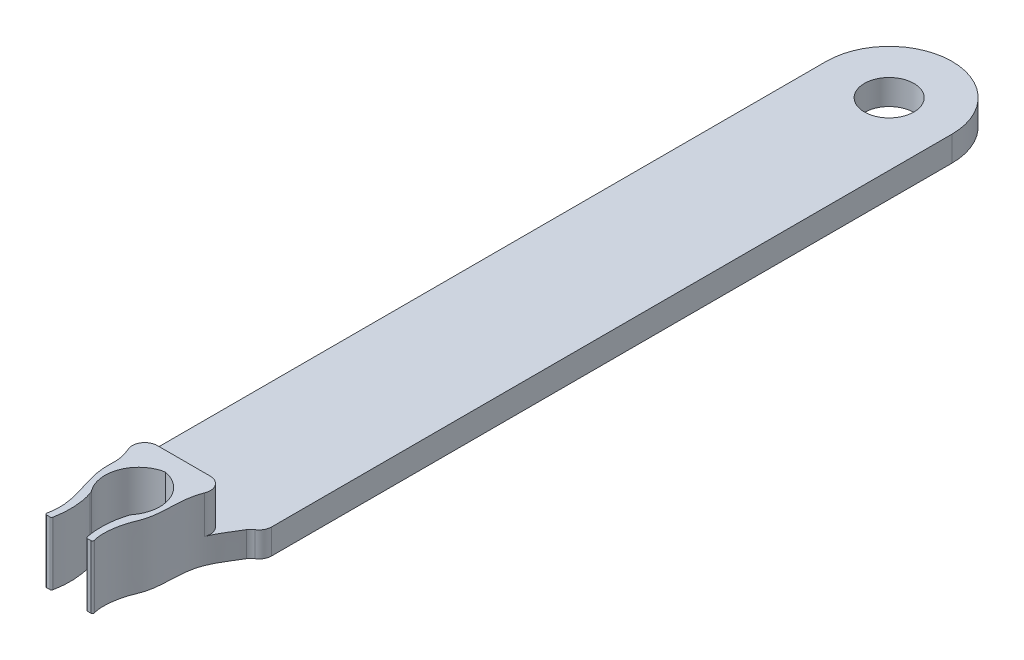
ISO-10303-21;
HEADER;
FILE_DESCRIPTION(('STEP AP214'),'2;1');
FILE_NAME('part.step','',(''),(''),'','','');
FILE_SCHEMA(('AUTOMOTIVE_DESIGN { 1 0 10303 214 1 1 1 1 }'));
ENDSEC;
DATA;
#1=APPLICATION_CONTEXT('core data for automotive mechanical design processes');
#2=APPLICATION_PROTOCOL_DEFINITION('international standard','automotive_design',2000,#1);
#3=PRODUCT_CONTEXT('',#1,'mechanical');
#4=PRODUCT('Part','Part','',(#3));
#5=PRODUCT_RELATED_PRODUCT_CATEGORY('part','',(#4));
#6=PRODUCT_DEFINITION_FORMATION('','',#4);
#7=PRODUCT_DEFINITION_CONTEXT('part definition',#1,'design');
#8=PRODUCT_DEFINITION('design','',#6,#7);
#9=PRODUCT_DEFINITION_SHAPE('','',#8);
#10=(LENGTH_UNIT() NAMED_UNIT(*) SI_UNIT(.MILLI.,.METRE.));
#11=(NAMED_UNIT(*) PLANE_ANGLE_UNIT() SI_UNIT($,.RADIAN.));
#12=(NAMED_UNIT(*) SI_UNIT($,.STERADIAN.) SOLID_ANGLE_UNIT());
#13=UNCERTAINTY_MEASURE_WITH_UNIT(LENGTH_MEASURE(1.E-05),#10,'distance_accuracy_value','');
#14=(GEOMETRIC_REPRESENTATION_CONTEXT(3) GLOBAL_UNCERTAINTY_ASSIGNED_CONTEXT((#13)) GLOBAL_UNIT_ASSIGNED_CONTEXT((#10,
#11,#12)) REPRESENTATION_CONTEXT('',''));
#15=CARTESIAN_POINT('',(0.,0.,0.));
#16=DIRECTION('',(0.,0.,1.));
#17=DIRECTION('',(1.,0.,0.));
#18=AXIS2_PLACEMENT_3D('',#15,#16,#17);
#19=CARTESIAN_POINT('',(-6.93411925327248,12.7,15.7482204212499));
#20=DIRECTION('',(0.,-1.,0.));
#21=DIRECTION('',(0.,0.,-1.));
#22=AXIS2_PLACEMENT_3D('',#19,#20,#21);
#23=PLANE('',#22);
#24=CARTESIAN_POINT('',(4.77346849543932,12.7,31.7962230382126));
#25=CARTESIAN_POINT('',(4.26261652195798,12.7,30.1479997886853));
#26=CARTESIAN_POINT('',(4.52523901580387,12.7,26.6602313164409));
#27=CARTESIAN_POINT('',(7.08560364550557,12.7,20.9954102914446));
#28=CARTESIAN_POINT('',(5.48854782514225,12.7,11.2875043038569));
#29=CARTESIAN_POINT('',(12.8342449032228,12.7,5.63803468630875));
#30=CARTESIAN_POINT('',(12.6900757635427,12.7,0.501973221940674));
#31=B_SPLINE_CURVE_WITH_KNOTS('',3,(#24,#25,#26,#27,#28,#29,#30),.UNSPECIFIED.,.F.,.F.,(4,1,1,1,
4),(0.,0.239032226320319,0.296991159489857,0.579589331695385,1.),.UNSPECIFIED.);
#32=CARTESIAN_POINT('',(4.77346849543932,12.7,31.7962230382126));
#33=VERTEX_POINT('',#32);
#34=CARTESIAN_POINT('',(7.61044065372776,12.7,12.3712513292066));
#35=VERTEX_POINT('',#34);
#36=EDGE_CURVE('E324',#33,#35,#31,.T.);
#37=ORIENTED_EDGE('',*,*,#36,.T.);
#38=CARTESIAN_POINT('',(5.25127852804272,12.7,11.43));
#39=DIRECTION('',(0.,-1.,0.));
#40=DIRECTION('',(0.,0.,-1.));
#41=AXIS2_PLACEMENT_3D('',#38,#39,#40);
#42=CIRCLE('',#41,2.54);
#43=CARTESIAN_POINT('',(5.25127852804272,12.7,8.89));
#44=VERTEX_POINT('',#43);
#45=EDGE_CURVE('E261',#35,#44,#42,.F.);
#46=ORIENTED_EDGE('',*,*,#45,.T.);
#47=DIRECTION('',(-1.,0.,0.));
#48=VECTOR('',#47,1.);
#49=CARTESIAN_POINT('',(-12.7,12.7,8.89));
#50=LINE('',#49,#48);
#51=CARTESIAN_POINT('',(-5.41802610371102,12.7,8.89));
#52=VERTEX_POINT('',#51);
#53=EDGE_CURVE('E232',#44,#52,#50,.T.);
#54=ORIENTED_EDGE('',*,*,#53,.T.);
#55=CARTESIAN_POINT('',(-5.41802610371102,12.7,11.43));
#56=DIRECTION('',(0.,-1.,0.));
#57=DIRECTION('',(0.,0.,-1.));
#58=AXIS2_PLACEMENT_3D('',#55,#56,#57);
#59=CIRCLE('',#58,2.54);
#60=CARTESIAN_POINT('',(-7.74292579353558,12.7,12.4529571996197));
#61=VERTEX_POINT('',#60);
#62=EDGE_CURVE('E259',#52,#61,#59,.F.);
#63=ORIENTED_EDGE('',*,*,#62,.T.);
#64=CARTESIAN_POINT('',(-12.6900757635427,12.7,0.50197322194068));
#65=CARTESIAN_POINT('',(-12.7085946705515,12.7,0.534595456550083));
#66=CARTESIAN_POINT('',(-12.9445111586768,12.7,3.81873144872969));
#67=CARTESIAN_POINT('',(-6.44251711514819,12.7,13.8864500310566));
#68=CARTESIAN_POINT('',(-7.36026092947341,12.7,18.4591788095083));
#69=CARTESIAN_POINT('',(-5.27387900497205,12.7,24.7590934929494));
#70=CARTESIAN_POINT('',(-4.15604476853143,12.7,29.0328933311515));
#71=CARTESIAN_POINT('',(-4.77346849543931,12.7,31.7962230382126));
#72=B_SPLINE_CURVE_WITH_KNOTS('',3,(#64,#65,#66,#67,#68,#69,#70,#71),.UNSPECIFIED.,.F.,.F.,(4,1,
1,1,1,4),(0.,0.279659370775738,0.433863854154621,0.566787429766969,0.759908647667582,
0.988953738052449),.UNSPECIFIED.);
#73=CARTESIAN_POINT('',(-4.77346849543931,12.7,31.7962230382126));
#74=VERTEX_POINT('',#73);
#75=EDGE_CURVE('E253',#61,#74,#72,.T.);
#76=ORIENTED_EDGE('',*,*,#75,.T.);
#77=CARTESIAN_POINT('',(-4.45105676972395,12.7,31.8682610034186));
#78=DIRECTION('',(0.,1.,0.));
#79=DIRECTION('',(0.,0.,1.));
#80=AXIS2_PLACEMENT_3D('',#77,#78,#79);
#81=CIRCLE('',#80,0.330361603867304);
#82=CARTESIAN_POINT('',(-4.45105676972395,12.7,32.1986226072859));
#83=VERTEX_POINT('',#82);
#84=EDGE_CURVE('E242',#74,#83,#81,.T.);
#85=ORIENTED_EDGE('',*,*,#84,.T.);
#86=DIRECTION('',(1.,0.,0.));
#87=VECTOR('',#86,1.);
#88=CARTESIAN_POINT('',(-4.45105676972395,12.7,32.1986226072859));
#89=LINE('',#88,#87);
#90=CARTESIAN_POINT('',(-3.77597646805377,12.7,32.1986226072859));
#91=VERTEX_POINT('',#90);
#92=EDGE_CURVE('E605',#83,#91,#89,.T.);
#93=ORIENTED_EDGE('',*,*,#92,.T.);
#94=CARTESIAN_POINT('',(-3.77597646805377,12.7,31.8682610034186));
#95=DIRECTION('',(0.,1.,0.));
#96=DIRECTION('',(0.,0.,-1.));
#97=AXIS2_PLACEMENT_3D('',#94,#95,#96);
#98=CIRCLE('',#97,0.330361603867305);
#99=CARTESIAN_POINT('',(-3.45189480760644,12.7,31.932369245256));
#100=VERTEX_POINT('',#99);
#101=EDGE_CURVE('E488',#91,#100,#98,.T.);
#102=ORIENTED_EDGE('',*,*,#101,.T.);
#103=CARTESIAN_POINT('',(-3.45189480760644,12.7,31.932369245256));
#104=CARTESIAN_POINT('',(-3.03837590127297,12.7,29.8419376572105));
#105=CARTESIAN_POINT('',(-3.0285914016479,12.7,27.2020407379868));
#106=CARTESIAN_POINT('',(-3.6668448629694,12.7,24.6575247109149));
#107=CARTESIAN_POINT('',(-3.83488723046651,12.7,24.1124032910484));
#108=B_SPLINE_CURVE_WITH_KNOTS('',3,(#103,#104,#105,#106,#107),.UNSPECIFIED.,.F.,.F.,(4,1,4),
(0.0550755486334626,0.772138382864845,0.969570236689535),.UNSPECIFIED.);
#109=CARTESIAN_POINT('',(-3.83488723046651,12.7,24.1124032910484));
#110=VERTEX_POINT('',#109);
#111=EDGE_CURVE('E505',#100,#110,#108,.T.);
#112=ORIENTED_EDGE('',*,*,#111,.T.);
#113=CARTESIAN_POINT('',(-6.26217420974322,12.7,24.8606531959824));
#114=DIRECTION('',(0.,1.,0.));
#115=DIRECTION('',(0.,0.,-1.));
#116=AXIS2_PLACEMENT_3D('',#113,#114,#115);
#117=CIRCLE('',#116,2.54);
#118=CARTESIAN_POINT('',(-4.21241176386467,12.7,23.3606285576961));
#119=VERTEX_POINT('',#118);
#120=EDGE_CURVE('E502',#110,#119,#117,.T.);
#121=ORIENTED_EDGE('',*,*,#120,.T.);
#122=CARTESIAN_POINT('',(1.25597785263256,12.7,19.3588384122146));
#123=DIRECTION('',(0.,-1.,0.));
#124=DIRECTION('',(0.,0.,1.));
#125=AXIS2_PLACEMENT_3D('',#122,#123,#124);
#126=CIRCLE('',#125,6.77625334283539);
#127=CARTESIAN_POINT('',(0.,12.7,12.7));
#128=VERTEX_POINT('',#127);
#129=EDGE_CURVE('E504',#119,#128,#126,.T.);
#130=ORIENTED_EDGE('',*,*,#129,.T.);
#131=CARTESIAN_POINT('',(-1.25597785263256,12.7,19.3588384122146));
#132=DIRECTION('',(0.,-1.,0.));
#133=DIRECTION('',(0.,0.,-1.));
#134=AXIS2_PLACEMENT_3D('',#131,#132,#133);
#135=CIRCLE('',#134,6.77625334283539);
#136=CARTESIAN_POINT('',(4.21241176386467,12.7,23.3606285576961));
#137=VERTEX_POINT('',#136);
#138=EDGE_CURVE('E507',#128,#137,#135,.T.);
#139=ORIENTED_EDGE('',*,*,#138,.T.);
#140=CARTESIAN_POINT('',(6.26217420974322,12.7,24.8606531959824));
#141=DIRECTION('',(0.,1.,0.));
#142=DIRECTION('',(0.,0.,1.));
#143=AXIS2_PLACEMENT_3D('',#140,#141,#142);
#144=CIRCLE('',#143,2.54);
#145=CARTESIAN_POINT('',(3.83488723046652,12.7,24.1124032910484));
#146=VERTEX_POINT('',#145);
#147=EDGE_CURVE('E374',#137,#146,#144,.T.);
#148=ORIENTED_EDGE('',*,*,#147,.T.);
#149=CARTESIAN_POINT('',(3.83488723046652,12.7,24.1124032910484));
#150=CARTESIAN_POINT('',(3.66684486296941,12.7,24.6575247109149));
#151=CARTESIAN_POINT('',(3.02859140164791,12.7,27.2020407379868));
#152=CARTESIAN_POINT('',(3.03837590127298,12.7,29.8419376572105));
#153=CARTESIAN_POINT('',(3.45189480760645,12.7,31.932369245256));
#154=B_SPLINE_CURVE_WITH_KNOTS('',3,(#149,#150,#151,#152,#153),.UNSPECIFIED.,.F.,.F.,(4,1,4),
(0.0550755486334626,0.252507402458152,0.969570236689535),.UNSPECIFIED.);
#155=CARTESIAN_POINT('',(3.45189480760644,12.7,31.932369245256));
#156=VERTEX_POINT('',#155);
#157=EDGE_CURVE('E367',#146,#156,#154,.T.);
#158=ORIENTED_EDGE('',*,*,#157,.T.);
#159=CARTESIAN_POINT('',(3.77597646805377,12.7,31.8682610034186));
#160=DIRECTION('',(0.,1.,0.));
#161=DIRECTION('',(0.,0.,1.));
#162=AXIS2_PLACEMENT_3D('',#159,#160,#161);
#163=CIRCLE('',#162,0.330361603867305);
#164=CARTESIAN_POINT('',(3.77597646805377,12.7,32.1986226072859));
#165=VERTEX_POINT('',#164);
#166=EDGE_CURVE('E373',#156,#165,#163,.T.);
#167=ORIENTED_EDGE('',*,*,#166,.T.);
#168=DIRECTION('',(1.,0.,0.));
#169=VECTOR('',#168,1.);
#170=CARTESIAN_POINT('',(4.45105676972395,12.7,32.1986226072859));
#171=LINE('',#170,#169);
#172=CARTESIAN_POINT('',(4.45105676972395,12.7,32.1986226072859));
#173=VERTEX_POINT('',#172);
#174=EDGE_CURVE('E379',#165,#173,#171,.T.);
#175=ORIENTED_EDGE('',*,*,#174,.T.);
#176=CARTESIAN_POINT('',(4.45105676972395,12.7,31.8682610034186));
#177=DIRECTION('',(0.,1.,0.));
#178=DIRECTION('',(0.,0.,-1.));
#179=AXIS2_PLACEMENT_3D('',#176,#177,#178);
#180=CIRCLE('',#179,0.330361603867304);
#181=EDGE_CURVE('E327',#173,#33,#180,.T.);
#182=ORIENTED_EDGE('',*,*,#181,.T.);
#183=EDGE_LOOP('',(#37,#46,#54,#63,#76,#85,#93,#102,#112,#121,#130,#139,#148,#158,#167,#175,#182));
#184=FACE_BOUND('',#183,.T.);
#185=ADVANCED_FACE('F32',(#184),#23,.F.);
#186=DIRECTION('',(0.,-1.,0.));
#187=VECTOR('',#186,1.);
#188=SURFACE_OF_LINEAR_EXTRUSION('',#72,#187);
#189=CARTESIAN_POINT('',(-12.6900757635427,5.08,0.50197322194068));
#190=CARTESIAN_POINT('',(-12.7085946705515,5.08,0.534595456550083));
#191=CARTESIAN_POINT('',(-12.9445111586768,5.08,3.81873144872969));
#192=CARTESIAN_POINT('',(-6.44251711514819,5.08,13.8864500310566));
#193=CARTESIAN_POINT('',(-7.36026092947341,5.08,18.4591788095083));
#194=CARTESIAN_POINT('',(-5.27387900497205,5.08,24.7590934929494));
#195=CARTESIAN_POINT('',(-4.15604476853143,5.08,29.0328933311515));
#196=CARTESIAN_POINT('',(-4.77346849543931,5.08,31.7962230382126));
#197=B_SPLINE_CURVE_WITH_KNOTS('',3,(#189,#190,#191,#192,#193,#194,#195,#196),.UNSPECIFIED.,.F.,
.F.,(4,1,1,1,1,4),(0.,0.279659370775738,0.433863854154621,0.566787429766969,0.759908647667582,
0.988953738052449),.UNSPECIFIED.);
#198=CARTESIAN_POINT('',(-10.6093893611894,5.08,7.06233555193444));
#199=VERTEX_POINT('',#198);
#200=CARTESIAN_POINT('',(-7.74292579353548,5.08,12.4529571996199));
#201=VERTEX_POINT('',#200);
#202=EDGE_CURVE('E290',#199,#201,#197,.T.);
#203=ORIENTED_EDGE('',*,*,#202,.F.);
#204=DIRECTION('',(0.,-1.,0.));
#205=VECTOR('',#204,1.);
#206=CARTESIAN_POINT('',(-10.6093893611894,5.08,7.06233555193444));
#207=LINE('',#206,#205);
#208=CARTESIAN_POINT('',(-10.6093893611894,0.,7.06233555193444));
#209=VERTEX_POINT('',#208);
#210=EDGE_CURVE('E289',#199,#209,#207,.T.);
#211=ORIENTED_EDGE('',*,*,#210,.T.);
#212=CARTESIAN_POINT('',(-12.6900757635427,0.,0.50197322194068));
#213=CARTESIAN_POINT('',(-12.7085946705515,0.,0.534595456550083));
#214=CARTESIAN_POINT('',(-12.9445111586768,0.,3.81873144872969));
#215=CARTESIAN_POINT('',(-6.44251711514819,0.,13.8864500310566));
#216=CARTESIAN_POINT('',(-7.36026092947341,0.,18.4591788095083));
#217=CARTESIAN_POINT('',(-5.27387900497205,0.,24.7590934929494));
#218=CARTESIAN_POINT('',(-4.15604476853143,0.,29.0328933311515));
#219=CARTESIAN_POINT('',(-4.77346849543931,0.,31.7962230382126));
#220=B_SPLINE_CURVE_WITH_KNOTS('',3,(#212,#213,#214,#215,#216,#217,#218,#219),.UNSPECIFIED.,.F.,
.F.,(4,1,1,1,1,4),(0.,0.279659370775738,0.433863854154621,0.566787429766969,0.759908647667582,
0.988953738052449),.UNSPECIFIED.);
#221=CARTESIAN_POINT('',(-4.77346849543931,0.,31.7962230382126));
#222=VERTEX_POINT('',#221);
#223=EDGE_CURVE('E293',#209,#222,#220,.T.);
#224=ORIENTED_EDGE('',*,*,#223,.T.);
#225=DIRECTION('',(0.,-1.,0.));
#226=VECTOR('',#225,1.);
#227=CARTESIAN_POINT('',(-4.77346849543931,12.7,31.7962230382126));
#228=LINE('',#227,#226);
#229=EDGE_CURVE('E308',#74,#222,#228,.T.);
#230=ORIENTED_EDGE('',*,*,#229,.F.);
#231=ORIENTED_EDGE('',*,*,#75,.F.);
#232=DIRECTION('',(0.,-1.,0.));
#233=VECTOR('',#232,1.);
#234=CARTESIAN_POINT('',(-7.74292579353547,12.7,12.4529571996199));
#235=LINE('',#234,#233);
#236=EDGE_CURVE('E268',#61,#201,#235,.T.);
#237=ORIENTED_EDGE('',*,*,#236,.T.);
#238=EDGE_LOOP('',(#203,#211,#224,#230,#231,#237));
#239=FACE_BOUND('',#238,.T.);
#240=ADVANCED_FACE('F249',(#239),#188,.F.);
#241=DIRECTION('',(0.,-1.,0.));
#242=VECTOR('',#241,1.);
#243=SURFACE_OF_LINEAR_EXTRUSION('',#31,#242);
#244=CARTESIAN_POINT('',(4.77346849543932,0.,31.7962230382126));
#245=CARTESIAN_POINT('',(4.26261652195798,0.,30.1479997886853));
#246=CARTESIAN_POINT('',(4.52523901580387,0.,26.6602313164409));
#247=CARTESIAN_POINT('',(7.08560364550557,0.,20.9954102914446));
#248=CARTESIAN_POINT('',(5.48854782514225,0.,11.2875043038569));
#249=CARTESIAN_POINT('',(12.8342449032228,0.,5.63803468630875));
#250=CARTESIAN_POINT('',(12.6900757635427,0.,0.501973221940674));
#251=B_SPLINE_CURVE_WITH_KNOTS('',3,(#244,#245,#246,#247,#248,#249,#250),.UNSPECIFIED.,.F.,.F.,
(4,1,1,1,4),(0.,0.239032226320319,0.296991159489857,0.579589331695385,1.),.UNSPECIFIED.);
#252=CARTESIAN_POINT('',(4.77346849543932,0.,31.7962230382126));
#253=VERTEX_POINT('',#252);
#254=CARTESIAN_POINT('',(10.6212860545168,0.,6.99353899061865));
#255=VERTEX_POINT('',#254);
#256=EDGE_CURVE('E256',#253,#255,#251,.T.);
#257=ORIENTED_EDGE('',*,*,#256,.T.);
#258=DIRECTION('',(0.,-1.,0.));
#259=VECTOR('',#258,1.);
#260=CARTESIAN_POINT('',(10.6212860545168,0.,6.99353899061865));
#261=LINE('',#260,#259);
#262=CARTESIAN_POINT('',(10.6212860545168,5.08,6.99353899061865));
#263=VERTEX_POINT('',#262);
#264=EDGE_CURVE('E395',#255,#263,#261,.F.);
#265=ORIENTED_EDGE('',*,*,#264,.T.);
#266=CARTESIAN_POINT('',(4.77346849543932,5.08,31.7962230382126));
#267=CARTESIAN_POINT('',(4.26261652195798,5.08,30.1479997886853));
#268=CARTESIAN_POINT('',(4.52523901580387,5.08,26.6602313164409));
#269=CARTESIAN_POINT('',(7.08560364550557,5.08,20.9954102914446));
#270=CARTESIAN_POINT('',(5.48854782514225,5.08,11.2875043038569));
#271=CARTESIAN_POINT('',(12.8342449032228,5.08,5.63803468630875));
#272=CARTESIAN_POINT('',(12.6900757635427,5.08,0.501973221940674));
#273=B_SPLINE_CURVE_WITH_KNOTS('',3,(#266,#267,#268,#269,#270,#271,#272),.UNSPECIFIED.,.F.,.F.,
(4,1,1,1,4),(0.,0.239032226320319,0.296991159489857,0.579589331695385,1.),.UNSPECIFIED.);
#274=CARTESIAN_POINT('',(7.61044065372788,5.08,12.3712513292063));
#275=VERTEX_POINT('',#274);
#276=EDGE_CURVE('E237',#275,#263,#273,.T.);
#277=ORIENTED_EDGE('',*,*,#276,.F.);
#278=DIRECTION('',(0.,-1.,0.));
#279=VECTOR('',#278,1.);
#280=CARTESIAN_POINT('',(7.61044065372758,5.08,12.3712513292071));
#281=LINE('',#280,#279);
#282=EDGE_CURVE('E262',#275,#35,#281,.F.);
#283=ORIENTED_EDGE('',*,*,#282,.T.);
#284=ORIENTED_EDGE('',*,*,#36,.F.);
#285=DIRECTION('',(0.,-1.,0.));
#286=VECTOR('',#285,1.);
#287=CARTESIAN_POINT('',(4.77346849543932,12.7,31.7962230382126));
#288=LINE('',#287,#286);
#289=EDGE_CURVE('E326',#33,#253,#288,.T.);
#290=ORIENTED_EDGE('',*,*,#289,.T.);
#291=EDGE_LOOP('',(#257,#265,#277,#283,#284,#290));
#292=FACE_BOUND('',#291,.T.);
#293=ADVANCED_FACE('F342',(#292),#243,.F.);
#294=CARTESIAN_POINT('',(-6.93411925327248,0.,15.7482204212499));
#295=DIRECTION('',(0.,-1.,0.));
#296=DIRECTION('',(0.,0.,-1.));
#297=AXIS2_PLACEMENT_3D('',#294,#295,#296);
#298=PLANE('',#297);
#299=CARTESIAN_POINT('',(0.,0.,-133.35));
#300=DIRECTION('',(0.,1.,0.));
#301=DIRECTION('',(0.,0.,1.));
#302=AXIS2_PLACEMENT_3D('',#299,#300,#301);
#303=CIRCLE('',#302,4.99999);
#304=CARTESIAN_POINT('',(0.,0.,-128.35001));
#305=VERTEX_POINT('',#304);
#306=EDGE_CURVE('E229',#305,#305,#303,.T.);
#307=ORIENTED_EDGE('',*,*,#306,.T.);
#308=EDGE_LOOP('',(#307));
#309=FACE_BOUND('',#308,.T.);
#310=DIRECTION('',(0.,0.,-1.));
#311=VECTOR('',#310,1.);
#312=CARTESIAN_POINT('',(12.7,0.,6.35));
#313=LINE('',#312,#311);
#314=CARTESIAN_POINT('',(12.7,0.,3.94992772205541));
#315=VERTEX_POINT('',#314);
#316=CARTESIAN_POINT('',(12.7,0.,-133.35));
#317=VERTEX_POINT('',#316);
#318=EDGE_CURVE('E198',#315,#317,#313,.T.);
#319=ORIENTED_EDGE('',*,*,#318,.F.);
#320=CARTESIAN_POINT('',(10.16,0.,3.94992772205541));
#321=DIRECTION('',(0.,-1.,0.));
#322=DIRECTION('',(0.,0.,-1.));
#323=AXIS2_PLACEMENT_3D('',#320,#321,#322);
#324=CIRCLE('',#323,2.54);
#325=CARTESIAN_POINT('',(11.4842719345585,0.,6.11739256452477));
#326=VERTEX_POINT('',#325);
#327=EDGE_CURVE('E284',#315,#326,#324,.T.);
#328=ORIENTED_EDGE('',*,*,#327,.T.);
#329=CARTESIAN_POINT('',(12.8085438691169,0.,8.28485740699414));
#330=DIRECTION('',(0.,-1.,0.));
#331=DIRECTION('',(0.,0.,-1.));
#332=AXIS2_PLACEMENT_3D('',#329,#330,#331);
#333=CIRCLE('',#332,2.54);
#334=EDGE_CURVE('E11',#326,#255,#333,.F.);
#335=ORIENTED_EDGE('',*,*,#334,.T.);
#336=ORIENTED_EDGE('',*,*,#256,.F.);
#337=CARTESIAN_POINT('',(4.45105676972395,0.,31.8682610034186));
#338=DIRECTION('',(0.,1.,0.));
#339=DIRECTION('',(0.,0.,-1.));
#340=AXIS2_PLACEMENT_3D('',#337,#338,#339);
#341=CIRCLE('',#340,0.330361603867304);
#342=CARTESIAN_POINT('',(4.45105676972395,0.,32.1986226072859));
#343=VERTEX_POINT('',#342);
#344=EDGE_CURVE('E388',#343,#253,#341,.T.);
#345=ORIENTED_EDGE('',*,*,#344,.F.);
#346=DIRECTION('',(1.,0.,0.));
#347=VECTOR('',#346,1.);
#348=CARTESIAN_POINT('',(4.45105676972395,0.,32.1986226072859));
#349=LINE('',#348,#347);
#350=CARTESIAN_POINT('',(3.77597646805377,0.,32.1986226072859));
#351=VERTEX_POINT('',#350);
#352=EDGE_CURVE('E449',#351,#343,#349,.T.);
#353=ORIENTED_EDGE('',*,*,#352,.F.);
#354=CARTESIAN_POINT('',(3.77597646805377,0.,31.8682610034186));
#355=DIRECTION('',(0.,1.,0.));
#356=DIRECTION('',(0.,0.,1.));
#357=AXIS2_PLACEMENT_3D('',#354,#355,#356);
#358=CIRCLE('',#357,0.330361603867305);
#359=CARTESIAN_POINT('',(3.45189480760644,0.,31.932369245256));
#360=VERTEX_POINT('',#359);
#361=EDGE_CURVE('E444',#360,#351,#358,.T.);
#362=ORIENTED_EDGE('',*,*,#361,.F.);
#363=CARTESIAN_POINT('',(3.83488723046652,0.,24.1124032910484));
#364=CARTESIAN_POINT('',(3.66684486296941,0.,24.6575247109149));
#365=CARTESIAN_POINT('',(3.02859140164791,0.,27.2020407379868));
#366=CARTESIAN_POINT('',(3.03837590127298,0.,29.8419376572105));
#367=CARTESIAN_POINT('',(3.45189480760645,0.,31.932369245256));
#368=B_SPLINE_CURVE_WITH_KNOTS('',3,(#363,#364,#365,#366,#367),.UNSPECIFIED.,.F.,.F.,(4,1,4),
(0.0550755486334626,0.252507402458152,0.969570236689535),.UNSPECIFIED.);
#369=CARTESIAN_POINT('',(3.83488723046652,0.,24.1124032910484));
#370=VERTEX_POINT('',#369);
#371=EDGE_CURVE('E440',#370,#360,#368,.T.);
#372=ORIENTED_EDGE('',*,*,#371,.F.);
#373=CARTESIAN_POINT('',(6.26217420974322,0.,24.8606531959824));
#374=DIRECTION('',(0.,1.,0.));
#375=DIRECTION('',(0.,0.,1.));
#376=AXIS2_PLACEMENT_3D('',#373,#374,#375);
#377=CIRCLE('',#376,2.54);
#378=CARTESIAN_POINT('',(4.21241176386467,0.,23.3606285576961));
#379=VERTEX_POINT('',#378);
#380=EDGE_CURVE('E438',#379,#370,#377,.T.);
#381=ORIENTED_EDGE('',*,*,#380,.F.);
#382=CARTESIAN_POINT('',(-1.25597785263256,0.,19.3588384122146));
#383=DIRECTION('',(0.,-1.,0.));
#384=DIRECTION('',(0.,0.,-1.));
#385=AXIS2_PLACEMENT_3D('',#382,#383,#384);
#386=CIRCLE('',#385,6.77625334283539);
#387=CARTESIAN_POINT('',(0.,0.,12.7));
#388=VERTEX_POINT('',#387);
#389=EDGE_CURVE('E436',#388,#379,#386,.T.);
#390=ORIENTED_EDGE('',*,*,#389,.F.);
#391=CARTESIAN_POINT('',(1.25597785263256,0.,19.3588384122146));
#392=DIRECTION('',(0.,-1.,0.));
#393=DIRECTION('',(0.,0.,1.));
#394=AXIS2_PLACEMENT_3D('',#391,#392,#393);
#395=CIRCLE('',#394,6.77625334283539);
#396=CARTESIAN_POINT('',(-4.21241176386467,0.,23.3606285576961));
#397=VERTEX_POINT('',#396);
#398=EDGE_CURVE('E434',#397,#388,#395,.T.);
#399=ORIENTED_EDGE('',*,*,#398,.F.);
#400=CARTESIAN_POINT('',(-6.26217420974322,0.,24.8606531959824));
#401=DIRECTION('',(0.,1.,0.));
#402=DIRECTION('',(0.,0.,-1.));
#403=AXIS2_PLACEMENT_3D('',#400,#401,#402);
#404=CIRCLE('',#403,2.54);
#405=CARTESIAN_POINT('',(-3.83488723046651,0.,24.1124032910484));
#406=VERTEX_POINT('',#405);
#407=EDGE_CURVE('E429',#406,#397,#404,.T.);
#408=ORIENTED_EDGE('',*,*,#407,.F.);
#409=CARTESIAN_POINT('',(-3.45189480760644,0.,31.932369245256));
#410=CARTESIAN_POINT('',(-3.03837590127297,0.,29.8419376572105));
#411=CARTESIAN_POINT('',(-3.0285914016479,0.,27.2020407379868));
#412=CARTESIAN_POINT('',(-3.6668448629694,0.,24.6575247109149));
#413=CARTESIAN_POINT('',(-3.83488723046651,0.,24.1124032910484));
#414=B_SPLINE_CURVE_WITH_KNOTS('',3,(#409,#410,#411,#412,#413),.UNSPECIFIED.,.F.,.F.,(4,1,4),
(0.0550755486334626,0.772138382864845,0.969570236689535),.UNSPECIFIED.);
#415=CARTESIAN_POINT('',(-3.45189480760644,0.,31.932369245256));
#416=VERTEX_POINT('',#415);
#417=EDGE_CURVE('E425',#416,#406,#414,.T.);
#418=ORIENTED_EDGE('',*,*,#417,.F.);
#419=CARTESIAN_POINT('',(-3.77597646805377,0.,31.8682610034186));
#420=DIRECTION('',(0.,1.,0.));
#421=DIRECTION('',(0.,0.,-1.));
#422=AXIS2_PLACEMENT_3D('',#419,#420,#421);
#423=CIRCLE('',#422,0.330361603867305);
#424=CARTESIAN_POINT('',(-3.77597646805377,0.,32.1986226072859));
#425=VERTEX_POINT('',#424);
#426=EDGE_CURVE('E421',#425,#416,#423,.T.);
#427=ORIENTED_EDGE('',*,*,#426,.F.);
#428=DIRECTION('',(1.,0.,0.));
#429=VECTOR('',#428,1.);
#430=CARTESIAN_POINT('',(-4.45105676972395,0.,32.1986226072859));
#431=LINE('',#430,#429);
#432=CARTESIAN_POINT('',(-4.45105676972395,0.,32.1986226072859));
#433=VERTEX_POINT('',#432);
#434=EDGE_CURVE('E419',#433,#425,#431,.T.);
#435=ORIENTED_EDGE('',*,*,#434,.F.);
#436=CARTESIAN_POINT('',(-4.45105676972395,0.,31.8682610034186));
#437=DIRECTION('',(0.,1.,0.));
#438=DIRECTION('',(0.,0.,1.));
#439=AXIS2_PLACEMENT_3D('',#436,#437,#438);
#440=CIRCLE('',#439,0.330361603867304);
#441=EDGE_CURVE('E418',#222,#433,#440,.T.);
#442=ORIENTED_EDGE('',*,*,#441,.F.);
#443=ORIENTED_EDGE('',*,*,#223,.F.);
#444=CARTESIAN_POINT('',(-12.8539327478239,0.,8.25129517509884));
#445=DIRECTION('',(0.,-1.,0.));
#446=DIRECTION('',(0.,0.,-1.));
#447=AXIS2_PLACEMENT_3D('',#444,#445,#446);
#448=CIRCLE('',#447,2.54);
#449=CARTESIAN_POINT('',(-11.5069663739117,0.,6.09786034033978));
#450=VERTEX_POINT('',#449);
#451=EDGE_CURVE('E402',#209,#450,#448,.F.);
#452=ORIENTED_EDGE('',*,*,#451,.T.);
#453=CARTESIAN_POINT('',(-10.16,0.,3.94442550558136));
#454=DIRECTION('',(0.,-1.,0.));
#455=DIRECTION('',(0.,0.,-1.));
#456=AXIS2_PLACEMENT_3D('',#453,#454,#455);
#457=CIRCLE('',#456,2.54);
#458=CARTESIAN_POINT('',(-12.7,0.,3.94442550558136));
#459=VERTEX_POINT('',#458);
#460=EDGE_CURVE('E282',#450,#459,#457,.T.);
#461=ORIENTED_EDGE('',*,*,#460,.T.);
#462=DIRECTION('',(0.,0.,1.));
#463=VECTOR('',#462,1.);
#464=CARTESIAN_POINT('',(-12.7,0.,6.35));
#465=LINE('',#464,#463);
#466=CARTESIAN_POINT('',(-12.7,0.,-133.35));
#467=VERTEX_POINT('',#466);
#468=EDGE_CURVE('E209',#467,#459,#465,.T.);
#469=ORIENTED_EDGE('',*,*,#468,.F.);
#470=CARTESIAN_POINT('',(0.,0.,-133.35));
#471=DIRECTION('',(0.,1.,0.));
#472=DIRECTION('',(0.,0.,-1.));
#473=AXIS2_PLACEMENT_3D('',#470,#471,#472);
#474=CIRCLE('',#473,12.7);
#475=EDGE_CURVE('E208',#317,#467,#474,.T.);
#476=ORIENTED_EDGE('',*,*,#475,.F.);
#477=EDGE_LOOP('',(#319,#328,#335,#336,#345,#353,#362,#372,#381,#390,#399,#408,#418,#427,#435,
#442,#443,#452,#461,#469,#476));
#478=FACE_BOUND('',#477,.T.);
#479=ADVANCED_FACE('F220',(#309,#478),#298,.T.);
#480=CARTESIAN_POINT('',(-4.45105676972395,12.7,31.8682610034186));
#481=DIRECTION('',(0.,-1.,0.));
#482=DIRECTION('',(0.,0.,-1.));
#483=AXIS2_PLACEMENT_3D('',#480,#481,#482);
#484=CYLINDRICAL_SURFACE('',#483,0.330361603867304);
#485=ORIENTED_EDGE('',*,*,#441,.T.);
#486=DIRECTION('',(0.,-1.,0.));
#487=VECTOR('',#486,1.);
#488=CARTESIAN_POINT('',(-4.45105676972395,12.7,32.1986226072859));
#489=LINE('',#488,#487);
#490=EDGE_CURVE('E314',#83,#433,#489,.T.);
#491=ORIENTED_EDGE('',*,*,#490,.F.);
#492=ORIENTED_EDGE('',*,*,#84,.F.);
#493=ORIENTED_EDGE('',*,*,#229,.T.);
#494=EDGE_LOOP('',(#485,#491,#492,#493));
#495=FACE_BOUND('',#494,.T.);
#496=ADVANCED_FACE('F604',(#495),#484,.T.);
#497=CARTESIAN_POINT('',(-4.45105676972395,12.7,32.1986226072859));
#498=DIRECTION('',(0.,0.,-1.));
#499=DIRECTION('',(-1.,0.,0.));
#500=AXIS2_PLACEMENT_3D('',#497,#498,#499);
#501=PLANE('',#500);
#502=ORIENTED_EDGE('',*,*,#434,.T.);
#503=DIRECTION('',(0.,-1.,0.));
#504=VECTOR('',#503,1.);
#505=CARTESIAN_POINT('',(-3.77597646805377,12.7,32.1986226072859));
#506=LINE('',#505,#504);
#507=EDGE_CURVE('E320',#91,#425,#506,.T.);
#508=ORIENTED_EDGE('',*,*,#507,.F.);
#509=ORIENTED_EDGE('',*,*,#92,.F.);
#510=ORIENTED_EDGE('',*,*,#490,.T.);
#511=EDGE_LOOP('',(#502,#508,#509,#510));
#512=FACE_BOUND('',#511,.T.);
#513=ADVANCED_FACE('F606',(#512),#501,.F.);
#514=CARTESIAN_POINT('',(-3.77597646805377,12.7,31.8682610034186));
#515=DIRECTION('',(0.,-1.,0.));
#516=DIRECTION('',(0.,0.,-1.));
#517=AXIS2_PLACEMENT_3D('',#514,#515,#516);
#518=CYLINDRICAL_SURFACE('',#517,0.330361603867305);
#519=ORIENTED_EDGE('',*,*,#426,.T.);
#520=DIRECTION('',(0.,-1.,0.));
#521=VECTOR('',#520,1.);
#522=CARTESIAN_POINT('',(-3.45189480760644,12.7,31.932369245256));
#523=LINE('',#522,#521);
#524=EDGE_CURVE('E479',#100,#416,#523,.T.);
#525=ORIENTED_EDGE('',*,*,#524,.F.);
#526=ORIENTED_EDGE('',*,*,#101,.F.);
#527=ORIENTED_EDGE('',*,*,#507,.T.);
#528=EDGE_LOOP('',(#519,#525,#526,#527));
#529=FACE_BOUND('',#528,.T.);
#530=ADVANCED_FACE('F486',(#529),#518,.T.);
#531=DIRECTION('',(0.,-1.,0.));
#532=VECTOR('',#531,1.);
#533=SURFACE_OF_LINEAR_EXTRUSION('',#108,#532);
#534=ORIENTED_EDGE('',*,*,#417,.T.);
#535=DIRECTION('',(0.,-1.,0.));
#536=VECTOR('',#535,1.);
#537=CARTESIAN_POINT('',(-3.83488723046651,12.7,24.1124032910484));
#538=LINE('',#537,#536);
#539=EDGE_CURVE('E476',#110,#406,#538,.T.);
#540=ORIENTED_EDGE('',*,*,#539,.F.);
#541=ORIENTED_EDGE('',*,*,#111,.F.);
#542=ORIENTED_EDGE('',*,*,#524,.T.);
#543=EDGE_LOOP('',(#534,#540,#541,#542));
#544=FACE_BOUND('',#543,.T.);
#545=ADVANCED_FACE('F496',(#544),#533,.F.);
#546=CARTESIAN_POINT('',(-6.26217420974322,12.7,24.8606531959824));
#547=DIRECTION('',(0.,-1.,0.));
#548=DIRECTION('',(0.,0.,-1.));
#549=AXIS2_PLACEMENT_3D('',#546,#547,#548);
#550=CYLINDRICAL_SURFACE('',#549,2.54);
#551=ORIENTED_EDGE('',*,*,#407,.T.);
#552=DIRECTION('',(0.,-1.,0.));
#553=VECTOR('',#552,1.);
#554=CARTESIAN_POINT('',(-4.21241176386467,12.7,23.3606285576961));
#555=LINE('',#554,#553);
#556=EDGE_CURVE('E473',#119,#397,#555,.T.);
#557=ORIENTED_EDGE('',*,*,#556,.F.);
#558=ORIENTED_EDGE('',*,*,#120,.F.);
#559=ORIENTED_EDGE('',*,*,#539,.T.);
#560=EDGE_LOOP('',(#551,#557,#558,#559));
#561=FACE_BOUND('',#560,.T.);
#562=ADVANCED_FACE('F500',(#561),#550,.T.);
#563=CARTESIAN_POINT('',(1.25597785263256,12.7,19.3588384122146));
#564=DIRECTION('',(0.,-1.,0.));
#565=DIRECTION('',(0.,0.,-1.));
#566=AXIS2_PLACEMENT_3D('',#563,#564,#565);
#567=CYLINDRICAL_SURFACE('',#566,6.77625334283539);
#568=ORIENTED_EDGE('',*,*,#398,.T.);
#569=DIRECTION('',(0.,-1.,0.));
#570=VECTOR('',#569,1.);
#571=CARTESIAN_POINT('',(0.,12.7,12.7));
#572=LINE('',#571,#570);
#573=EDGE_CURVE('E470',#128,#388,#572,.T.);
#574=ORIENTED_EDGE('',*,*,#573,.F.);
#575=ORIENTED_EDGE('',*,*,#129,.F.);
#576=ORIENTED_EDGE('',*,*,#556,.T.);
#577=EDGE_LOOP('',(#568,#574,#575,#576));
#578=FACE_BOUND('',#577,.T.);
#579=ADVANCED_FACE('F532',(#578),#567,.F.);
#580=CARTESIAN_POINT('',(-1.25597785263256,12.7,19.3588384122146));
#581=DIRECTION('',(0.,-1.,0.));
#582=DIRECTION('',(0.,0.,-1.));
#583=AXIS2_PLACEMENT_3D('',#580,#581,#582);
#584=CYLINDRICAL_SURFACE('',#583,6.77625334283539);
#585=ORIENTED_EDGE('',*,*,#389,.T.);
#586=DIRECTION('',(0.,-1.,0.));
#587=VECTOR('',#586,1.);
#588=CARTESIAN_POINT('',(4.21241176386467,12.7,23.3606285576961));
#589=LINE('',#588,#587);
#590=EDGE_CURVE('E467',#137,#379,#589,.T.);
#591=ORIENTED_EDGE('',*,*,#590,.F.);
#592=ORIENTED_EDGE('',*,*,#138,.F.);
#593=ORIENTED_EDGE('',*,*,#573,.T.);
#594=EDGE_LOOP('',(#585,#591,#592,#593));
#595=FACE_BOUND('',#594,.T.);
#596=ADVANCED_FACE('F529',(#595),#584,.F.);
#597=CARTESIAN_POINT('',(6.26217420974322,12.7,24.8606531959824));
#598=DIRECTION('',(0.,-1.,0.));
#599=DIRECTION('',(0.,0.,-1.));
#600=AXIS2_PLACEMENT_3D('',#597,#598,#599);
#601=CYLINDRICAL_SURFACE('',#600,2.54);
#602=ORIENTED_EDGE('',*,*,#380,.T.);
#603=DIRECTION('',(0.,-1.,0.));
#604=VECTOR('',#603,1.);
#605=CARTESIAN_POINT('',(3.83488723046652,12.7,24.1124032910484));
#606=LINE('',#605,#604);
#607=EDGE_CURVE('E464',#146,#370,#606,.T.);
#608=ORIENTED_EDGE('',*,*,#607,.F.);
#609=ORIENTED_EDGE('',*,*,#147,.F.);
#610=ORIENTED_EDGE('',*,*,#590,.T.);
#611=EDGE_LOOP('',(#602,#608,#609,#610));
#612=FACE_BOUND('',#611,.T.);
#613=ADVANCED_FACE('F364',(#612),#601,.T.);
#614=DIRECTION('',(0.,-1.,0.));
#615=VECTOR('',#614,1.);
#616=SURFACE_OF_LINEAR_EXTRUSION('',#154,#615);
#617=ORIENTED_EDGE('',*,*,#371,.T.);
#618=DIRECTION('',(0.,-1.,0.));
#619=VECTOR('',#618,1.);
#620=CARTESIAN_POINT('',(3.45189480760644,12.7,31.932369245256));
#621=LINE('',#620,#619);
#622=EDGE_CURVE('E461',#156,#360,#621,.T.);
#623=ORIENTED_EDGE('',*,*,#622,.F.);
#624=ORIENTED_EDGE('',*,*,#157,.F.);
#625=ORIENTED_EDGE('',*,*,#607,.T.);
#626=EDGE_LOOP('',(#617,#623,#624,#625));
#627=FACE_BOUND('',#626,.T.);
#628=ADVANCED_FACE('F359',(#627),#616,.F.);
#629=CARTESIAN_POINT('',(3.77597646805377,12.7,31.8682610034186));
#630=DIRECTION('',(0.,-1.,0.));
#631=DIRECTION('',(0.,0.,-1.));
#632=AXIS2_PLACEMENT_3D('',#629,#630,#631);
#633=CYLINDRICAL_SURFACE('',#632,0.330361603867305);
#634=ORIENTED_EDGE('',*,*,#361,.T.);
#635=DIRECTION('',(0.,-1.,0.));
#636=VECTOR('',#635,1.);
#637=CARTESIAN_POINT('',(3.77597646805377,12.7,32.1986226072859));
#638=LINE('',#637,#636);
#639=EDGE_CURVE('E458',#165,#351,#638,.T.);
#640=ORIENTED_EDGE('',*,*,#639,.F.);
#641=ORIENTED_EDGE('',*,*,#166,.F.);
#642=ORIENTED_EDGE('',*,*,#622,.T.);
#643=EDGE_LOOP('',(#634,#640,#641,#642));
#644=FACE_BOUND('',#643,.T.);
#645=ADVANCED_FACE('F355',(#644),#633,.T.);
#646=CARTESIAN_POINT('',(4.45105676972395,12.7,32.1986226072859));
#647=DIRECTION('',(0.,0.,-1.));
#648=DIRECTION('',(-1.,0.,0.));
#649=AXIS2_PLACEMENT_3D('',#646,#647,#648);
#650=PLANE('',#649);
#651=ORIENTED_EDGE('',*,*,#352,.T.);
#652=DIRECTION('',(0.,-1.,0.));
#653=VECTOR('',#652,1.);
#654=CARTESIAN_POINT('',(4.45105676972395,12.7,32.1986226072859));
#655=LINE('',#654,#653);
#656=EDGE_CURVE('E391',#173,#343,#655,.T.);
#657=ORIENTED_EDGE('',*,*,#656,.F.);
#658=ORIENTED_EDGE('',*,*,#174,.F.);
#659=ORIENTED_EDGE('',*,*,#639,.T.);
#660=EDGE_LOOP('',(#651,#657,#658,#659));
#661=FACE_BOUND('',#660,.T.);
#662=ADVANCED_FACE('F351',(#661),#650,.F.);
#663=CARTESIAN_POINT('',(4.45105676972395,12.7,31.8682610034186));
#664=DIRECTION('',(0.,-1.,0.));
#665=DIRECTION('',(0.,0.,-1.));
#666=AXIS2_PLACEMENT_3D('',#663,#664,#665);
#667=CYLINDRICAL_SURFACE('',#666,0.330361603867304);
#668=ORIENTED_EDGE('',*,*,#344,.T.);
#669=ORIENTED_EDGE('',*,*,#289,.F.);
#670=ORIENTED_EDGE('',*,*,#181,.F.);
#671=ORIENTED_EDGE('',*,*,#656,.T.);
#672=EDGE_LOOP('',(#668,#669,#670,#671));
#673=FACE_BOUND('',#672,.T.);
#674=ADVANCED_FACE('F347',(#673),#667,.T.);
#675=CARTESIAN_POINT('',(-12.7,12.701,8.89));
#676=DIRECTION('',(0.,0.,-1.));
#677=DIRECTION('',(-1.,0.,0.));
#678=AXIS2_PLACEMENT_3D('',#675,#676,#677);
#679=PLANE('',#678);
#680=ORIENTED_EDGE('',*,*,#53,.F.);
#681=DIRECTION('',(0.,1.,0.));
#682=VECTOR('',#681,1.);
#683=CARTESIAN_POINT('',(5.25127852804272,5.08,8.89));
#684=LINE('',#683,#682);
#685=CARTESIAN_POINT('',(5.25127852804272,5.08,8.89));
#686=VERTEX_POINT('',#685);
#687=EDGE_CURVE('E266',#44,#686,#684,.F.);
#688=ORIENTED_EDGE('',*,*,#687,.T.);
#689=DIRECTION('',(1.,0.,0.));
#690=VECTOR('',#689,1.);
#691=CARTESIAN_POINT('',(-12.7,5.08,8.89));
#692=LINE('',#691,#690);
#693=CARTESIAN_POINT('',(-5.41802610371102,5.08,8.89));
#694=VERTEX_POINT('',#693);
#695=EDGE_CURVE('E234',#694,#686,#692,.T.);
#696=ORIENTED_EDGE('',*,*,#695,.F.);
#697=DIRECTION('',(0.,1.,0.));
#698=VECTOR('',#697,1.);
#699=CARTESIAN_POINT('',(-5.41802610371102,12.7,8.89));
#700=LINE('',#699,#698);
#701=EDGE_CURVE('E264',#694,#52,#700,.T.);
#702=ORIENTED_EDGE('',*,*,#701,.T.);
#703=EDGE_LOOP('',(#680,#688,#696,#702));
#704=FACE_BOUND('',#703,.T.);
#705=ADVANCED_FACE('F350',(#704),#679,.T.);
#706=CARTESIAN_POINT('',(0.,5.08,0.));
#707=DIRECTION('',(0.,-1.,0.));
#708=DIRECTION('',(0.,0.,-1.));
#709=AXIS2_PLACEMENT_3D('',#706,#707,#708);
#710=PLANE('',#709);
#711=CARTESIAN_POINT('',(0.,5.08,-133.35));
#712=DIRECTION('',(0.,1.,0.));
#713=DIRECTION('',(0.,0.,1.));
#714=AXIS2_PLACEMENT_3D('',#711,#712,#713);
#715=CIRCLE('',#714,4.99999);
#716=CARTESIAN_POINT('',(0.,5.08,-128.35001));
#717=VERTEX_POINT('',#716);
#718=EDGE_CURVE('E575',#717,#717,#715,.T.);
#719=ORIENTED_EDGE('',*,*,#718,.F.);
#720=EDGE_LOOP('',(#719));
#721=FACE_BOUND('',#720,.T.);
#722=ORIENTED_EDGE('',*,*,#276,.T.);
#723=CARTESIAN_POINT('',(12.8085438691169,5.08,8.28485740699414));
#724=DIRECTION('',(0.,-1.,0.));
#725=DIRECTION('',(0.,0.,-1.));
#726=AXIS2_PLACEMENT_3D('',#723,#724,#725);
#727=CIRCLE('',#726,2.54);
#728=CARTESIAN_POINT('',(11.4842719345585,5.08,6.11739256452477));
#729=VERTEX_POINT('',#728);
#730=EDGE_CURVE('E40',#263,#729,#727,.T.);
#731=ORIENTED_EDGE('',*,*,#730,.T.);
#732=CARTESIAN_POINT('',(10.16,5.08,3.94992772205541));
#733=DIRECTION('',(0.,-1.,0.));
#734=DIRECTION('',(0.,0.,-1.));
#735=AXIS2_PLACEMENT_3D('',#732,#733,#734);
#736=CIRCLE('',#735,2.54);
#737=CARTESIAN_POINT('',(12.7,5.08,3.94992772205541));
#738=VERTEX_POINT('',#737);
#739=EDGE_CURVE('E279',#729,#738,#736,.F.);
#740=ORIENTED_EDGE('',*,*,#739,.T.);
#741=DIRECTION('',(0.,0.,-1.));
#742=VECTOR('',#741,1.);
#743=CARTESIAN_POINT('',(12.7,5.08,6.35));
#744=LINE('',#743,#742);
#745=CARTESIAN_POINT('',(12.7,5.08,-133.35));
#746=VERTEX_POINT('',#745);
#747=EDGE_CURVE('E228',#738,#746,#744,.T.);
#748=ORIENTED_EDGE('',*,*,#747,.T.);
#749=CARTESIAN_POINT('',(0.,5.08,-133.35));
#750=DIRECTION('',(0.,1.,0.));
#751=DIRECTION('',(0.,0.,-1.));
#752=AXIS2_PLACEMENT_3D('',#749,#750,#751);
#753=CIRCLE('',#752,12.7);
#754=CARTESIAN_POINT('',(-12.7,5.08,-133.35));
#755=VERTEX_POINT('',#754);
#756=EDGE_CURVE('E216',#746,#755,#753,.T.);
#757=ORIENTED_EDGE('',*,*,#756,.T.);
#758=DIRECTION('',(0.,0.,1.));
#759=VECTOR('',#758,1.);
#760=CARTESIAN_POINT('',(-12.7,5.08,6.35));
#761=LINE('',#760,#759);
#762=CARTESIAN_POINT('',(-12.7,5.08,3.94442550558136));
#763=VERTEX_POINT('',#762);
#764=EDGE_CURVE('E225',#755,#763,#761,.T.);
#765=ORIENTED_EDGE('',*,*,#764,.T.);
#766=CARTESIAN_POINT('',(-10.16,5.08,3.94442550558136));
#767=DIRECTION('',(0.,-1.,0.));
#768=DIRECTION('',(0.,0.,-1.));
#769=AXIS2_PLACEMENT_3D('',#766,#767,#768);
#770=CIRCLE('',#769,2.54);
#771=CARTESIAN_POINT('',(-11.5069663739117,5.08,6.09786034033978));
#772=VERTEX_POINT('',#771);
#773=EDGE_CURVE('E276',#763,#772,#770,.F.);
#774=ORIENTED_EDGE('',*,*,#773,.T.);
#775=CARTESIAN_POINT('',(-12.8539327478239,5.08,8.25129517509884));
#776=DIRECTION('',(0.,-1.,0.));
#777=DIRECTION('',(0.,0.,-1.));
#778=AXIS2_PLACEMENT_3D('',#775,#776,#777);
#779=CIRCLE('',#778,2.54);
#780=EDGE_CURVE('E399',#772,#199,#779,.T.);
#781=ORIENTED_EDGE('',*,*,#780,.T.);
#782=ORIENTED_EDGE('',*,*,#202,.T.);
#783=CARTESIAN_POINT('',(-5.41802610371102,5.08,11.43));
#784=DIRECTION('',(0.,-1.,0.));
#785=DIRECTION('',(0.,0.,-1.));
#786=AXIS2_PLACEMENT_3D('',#783,#784,#785);
#787=CIRCLE('',#786,2.54);
#788=EDGE_CURVE('E274',#201,#694,#787,.T.);
#789=ORIENTED_EDGE('',*,*,#788,.T.);
#790=ORIENTED_EDGE('',*,*,#695,.T.);
#791=CARTESIAN_POINT('',(5.25127852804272,5.08,11.43));
#792=DIRECTION('',(0.,-1.,0.));
#793=DIRECTION('',(0.,0.,-1.));
#794=AXIS2_PLACEMENT_3D('',#791,#792,#793);
#795=CIRCLE('',#794,2.54);
#796=EDGE_CURVE('E271',#686,#275,#795,.T.);
#797=ORIENTED_EDGE('',*,*,#796,.T.);
#798=EDGE_LOOP('',(#722,#731,#740,#748,#757,#765,#774,#781,#782,#789,#790,#797));
#799=FACE_BOUND('',#798,.T.);
#800=ADVANCED_FACE('F547',(#721,#799),#710,.F.);
#801=CARTESIAN_POINT('',(5.25127852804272,8.89,11.43));
#802=DIRECTION('',(0.,-1.,0.));
#803=DIRECTION('',(0.,0.,-1.));
#804=AXIS2_PLACEMENT_3D('',#801,#802,#803);
#805=CYLINDRICAL_SURFACE('',#804,2.54);
#806=ORIENTED_EDGE('',*,*,#796,.F.);
#807=ORIENTED_EDGE('',*,*,#687,.F.);
#808=ORIENTED_EDGE('',*,*,#45,.F.);
#809=ORIENTED_EDGE('',*,*,#282,.F.);
#810=EDGE_LOOP('',(#806,#807,#808,#809));
#811=FACE_BOUND('',#810,.T.);
#812=ADVANCED_FACE('F551',(#811),#805,.T.);
#813=CARTESIAN_POINT('',(-5.41802610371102,8.89,11.43));
#814=DIRECTION('',(0.,-1.,0.));
#815=DIRECTION('',(0.,0.,-1.));
#816=AXIS2_PLACEMENT_3D('',#813,#814,#815);
#817=CYLINDRICAL_SURFACE('',#816,2.54);
#818=ORIENTED_EDGE('',*,*,#62,.F.);
#819=ORIENTED_EDGE('',*,*,#701,.F.);
#820=ORIENTED_EDGE('',*,*,#788,.F.);
#821=ORIENTED_EDGE('',*,*,#236,.F.);
#822=EDGE_LOOP('',(#818,#819,#820,#821));
#823=FACE_BOUND('',#822,.T.);
#824=ADVANCED_FACE('F556',(#823),#817,.T.);
#825=CARTESIAN_POINT('',(-12.7,0.,6.35));
#826=DIRECTION('',(-1.,0.,0.));
#827=DIRECTION('',(0.,0.,1.));
#828=AXIS2_PLACEMENT_3D('',#825,#826,#827);
#829=PLANE('',#828);
#830=ORIENTED_EDGE('',*,*,#468,.T.);
#831=DIRECTION('',(0.,1.,0.));
#832=VECTOR('',#831,1.);
#833=CARTESIAN_POINT('',(-12.7,5.08,3.94442550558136));
#834=LINE('',#833,#832);
#835=EDGE_CURVE('E286',#459,#763,#834,.T.);
#836=ORIENTED_EDGE('',*,*,#835,.T.);
#837=ORIENTED_EDGE('',*,*,#764,.F.);
#838=DIRECTION('',(0.,1.,0.));
#839=VECTOR('',#838,1.);
#840=CARTESIAN_POINT('',(-12.7,0.,-133.35));
#841=LINE('',#840,#839);
#842=EDGE_CURVE('E217',#467,#755,#841,.T.);
#843=ORIENTED_EDGE('',*,*,#842,.F.);
#844=EDGE_LOOP('',(#830,#836,#837,#843));
#845=FACE_BOUND('',#844,.T.);
#846=ADVANCED_FACE('F553',(#845),#829,.T.);
#847=CARTESIAN_POINT('',(12.7,0.,6.35));
#848=DIRECTION('',(1.,0.,0.));
#849=DIRECTION('',(0.,0.,-1.));
#850=AXIS2_PLACEMENT_3D('',#847,#848,#849);
#851=PLANE('',#850);
#852=ORIENTED_EDGE('',*,*,#747,.F.);
#853=DIRECTION('',(0.,1.,0.));
#854=VECTOR('',#853,1.);
#855=CARTESIAN_POINT('',(12.7,0.,3.94992772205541));
#856=LINE('',#855,#854);
#857=EDGE_CURVE('E205',#738,#315,#856,.F.);
#858=ORIENTED_EDGE('',*,*,#857,.T.);
#859=ORIENTED_EDGE('',*,*,#318,.T.);
#860=DIRECTION('',(0.,1.,0.));
#861=VECTOR('',#860,1.);
#862=CARTESIAN_POINT('',(12.7,0.,-133.35));
#863=LINE('',#862,#861);
#864=EDGE_CURVE('E202',#317,#746,#863,.T.);
#865=ORIENTED_EDGE('',*,*,#864,.T.);
#866=EDGE_LOOP('',(#852,#858,#859,#865));
#867=FACE_BOUND('',#866,.T.);
#868=ADVANCED_FACE('F201',(#867),#851,.T.);
#869=CARTESIAN_POINT('',(0.,0.,-133.35));
#870=DIRECTION('',(0.,1.,0.));
#871=DIRECTION('',(0.,0.,1.));
#872=AXIS2_PLACEMENT_3D('',#869,#870,#871);
#873=CYLINDRICAL_SURFACE('',#872,12.7);
#874=ORIENTED_EDGE('',*,*,#756,.F.);
#875=ORIENTED_EDGE('',*,*,#864,.F.);
#876=ORIENTED_EDGE('',*,*,#475,.T.);
#877=ORIENTED_EDGE('',*,*,#842,.T.);
#878=EDGE_LOOP('',(#874,#875,#876,#877));
#879=FACE_BOUND('',#878,.T.);
#880=ADVANCED_FACE('F213',(#879),#873,.T.);
#881=CARTESIAN_POINT('',(10.16,2.54,3.94992772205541));
#882=DIRECTION('',(0.,-1.,0.));
#883=DIRECTION('',(0.,0.,-1.));
#884=AXIS2_PLACEMENT_3D('',#881,#882,#883);
#885=CYLINDRICAL_SURFACE('',#884,2.54);
#886=ORIENTED_EDGE('',*,*,#739,.F.);
#887=DIRECTION('',(0.,-1.,0.));
#888=VECTOR('',#887,1.);
#889=CARTESIAN_POINT('',(11.4842719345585,2.54,6.11739256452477));
#890=LINE('',#889,#888);
#891=EDGE_CURVE('E53',#729,#326,#890,.T.);
#892=ORIENTED_EDGE('',*,*,#891,.T.);
#893=ORIENTED_EDGE('',*,*,#327,.F.);
#894=ORIENTED_EDGE('',*,*,#857,.F.);
#895=EDGE_LOOP('',(#886,#892,#893,#894));
#896=FACE_BOUND('',#895,.T.);
#897=ADVANCED_FACE('F562',(#896),#885,.T.);
#898=CARTESIAN_POINT('',(-10.16,2.54,3.94442550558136));
#899=DIRECTION('',(0.,-1.,0.));
#900=DIRECTION('',(0.,0.,-1.));
#901=AXIS2_PLACEMENT_3D('',#898,#899,#900);
#902=CYLINDRICAL_SURFACE('',#901,2.54);
#903=ORIENTED_EDGE('',*,*,#460,.F.);
#904=DIRECTION('',(0.,-1.,0.));
#905=VECTOR('',#904,1.);
#906=CARTESIAN_POINT('',(-11.5069663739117,2.54,6.09786034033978));
#907=LINE('',#906,#905);
#908=EDGE_CURVE('E405',#450,#772,#907,.F.);
#909=ORIENTED_EDGE('',*,*,#908,.T.);
#910=ORIENTED_EDGE('',*,*,#773,.F.);
#911=ORIENTED_EDGE('',*,*,#835,.F.);
#912=EDGE_LOOP('',(#903,#909,#910,#911));
#913=FACE_BOUND('',#912,.T.);
#914=ADVANCED_FACE('F579',(#913),#902,.T.);
#915=CARTESIAN_POINT('',(-12.8539327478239,2.54,8.25129517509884));
#916=DIRECTION('',(0.,-1.,0.));
#917=DIRECTION('',(0.,0.,-1.));
#918=AXIS2_PLACEMENT_3D('',#915,#916,#917);
#919=CYLINDRICAL_SURFACE('',#918,2.54);
#920=ORIENTED_EDGE('',*,*,#780,.F.);
#921=ORIENTED_EDGE('',*,*,#908,.F.);
#922=ORIENTED_EDGE('',*,*,#451,.F.);
#923=ORIENTED_EDGE('',*,*,#210,.F.);
#924=EDGE_LOOP('',(#920,#921,#922,#923));
#925=FACE_BOUND('',#924,.T.);
#926=ADVANCED_FACE('F569',(#925),#919,.F.);
#927=CARTESIAN_POINT('',(12.8085438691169,2.54,8.28485740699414));
#928=DIRECTION('',(0.,-1.,0.));
#929=DIRECTION('',(0.,0.,-1.));
#930=AXIS2_PLACEMENT_3D('',#927,#928,#929);
#931=CYLINDRICAL_SURFACE('',#930,2.54);
#932=ORIENTED_EDGE('',*,*,#334,.F.);
#933=ORIENTED_EDGE('',*,*,#891,.F.);
#934=ORIENTED_EDGE('',*,*,#730,.F.);
#935=ORIENTED_EDGE('',*,*,#264,.F.);
#936=EDGE_LOOP('',(#932,#933,#934,#935));
#937=FACE_BOUND('',#936,.T.);
#938=ADVANCED_FACE('F34',(#937),#931,.F.);
#939=CARTESIAN_POINT('',(0.,0.,-133.35));
#940=DIRECTION('',(0.,1.,0.));
#941=DIRECTION('',(0.,0.,1.));
#942=AXIS2_PLACEMENT_3D('',#939,#940,#941);
#943=CYLINDRICAL_SURFACE('',#942,4.99999);
#944=ORIENTED_EDGE('',*,*,#306,.F.);
#945=EDGE_LOOP('',(#944));
#946=FACE_BOUND('',#945,.T.);
#947=ORIENTED_EDGE('',*,*,#718,.T.);
#948=EDGE_LOOP('',(#947));
#949=FACE_BOUND('',#948,.T.);
#950=ADVANCED_FACE('F563',(#946,#949),#943,.F.);
#951=CLOSED_SHELL('',(#185,#240,#293,#479,#496,#513,#530,#545,#562,#579,#596,#613,#628,#645,
#662,#674,#705,#800,#812,#824,#846,#868,#880,#897,#914,#926,#938,#950));
#952=MANIFOLD_SOLID_BREP('B2',#951);
#953=ADVANCED_BREP_SHAPE_REPRESENTATION('',(#18,#952),#14);
#954=SHAPE_DEFINITION_REPRESENTATION(#9,#953);
ENDSEC;
END-ISO-10303-21;
